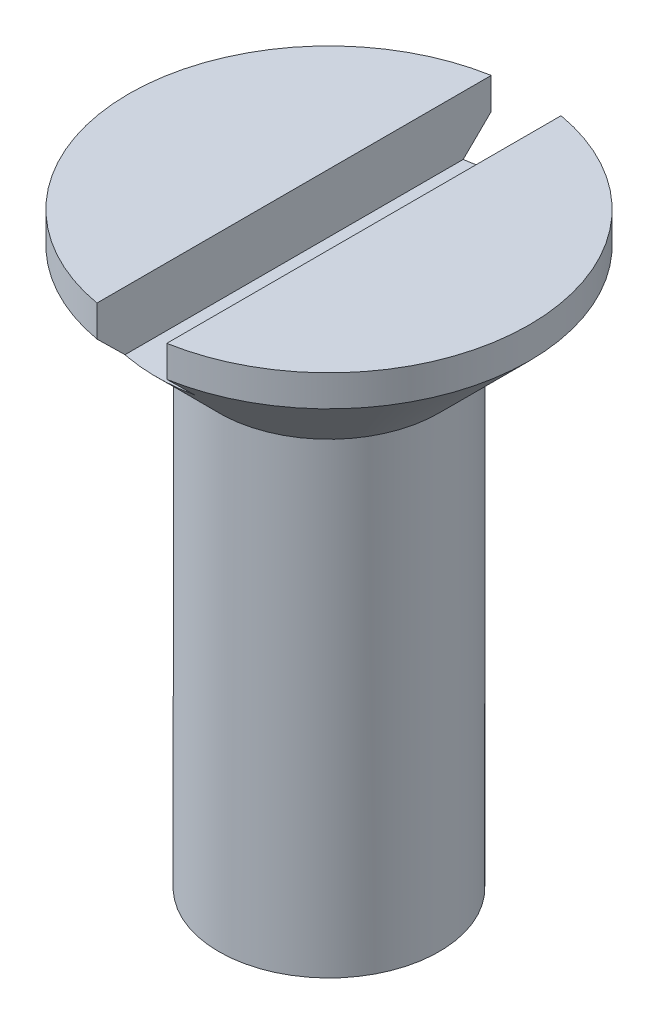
ISO-10303-21;
HEADER;
FILE_DESCRIPTION(('STEP AP214'),'2;1');
FILE_NAME('part.step','',(''),(''),'','','');
FILE_SCHEMA(('AUTOMOTIVE_DESIGN { 1 0 10303 214 1 1 1 1 }'));
ENDSEC;
DATA;
#1=APPLICATION_CONTEXT('core data for automotive mechanical design processes');
#2=APPLICATION_PROTOCOL_DEFINITION('international standard','automotive_design',2000,#1);
#3=PRODUCT_CONTEXT('',#1,'mechanical');
#4=PRODUCT('Part','Part','',(#3));
#5=PRODUCT_RELATED_PRODUCT_CATEGORY('part','',(#4));
#6=PRODUCT_DEFINITION_FORMATION('','',#4);
#7=PRODUCT_DEFINITION_CONTEXT('part definition',#1,'design');
#8=PRODUCT_DEFINITION('design','',#6,#7);
#9=PRODUCT_DEFINITION_SHAPE('','',#8);
#10=(LENGTH_UNIT() NAMED_UNIT(*) SI_UNIT(.MILLI.,.METRE.));
#11=(NAMED_UNIT(*) PLANE_ANGLE_UNIT() SI_UNIT($,.RADIAN.));
#12=(NAMED_UNIT(*) SI_UNIT($,.STERADIAN.) SOLID_ANGLE_UNIT());
#13=UNCERTAINTY_MEASURE_WITH_UNIT(LENGTH_MEASURE(1.E-05),#10,'distance_accuracy_value','');
#14=(GEOMETRIC_REPRESENTATION_CONTEXT(3) GLOBAL_UNCERTAINTY_ASSIGNED_CONTEXT((#13)) GLOBAL_UNIT_ASSIGNED_CONTEXT((#10,
#11,#12)) REPRESENTATION_CONTEXT('',''));
#15=CARTESIAN_POINT('',(0.,0.,0.));
#16=DIRECTION('',(0.,0.,1.));
#17=DIRECTION('',(1.,0.,0.));
#18=AXIS2_PLACEMENT_3D('',#15,#16,#17);
#19=CARTESIAN_POINT('',(0.,17.7320508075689,0.));
#20=DIRECTION('',(0.,-1.,0.));
#21=DIRECTION('',(0.,0.,-1.));
#22=AXIS2_PLACEMENT_3D('',#19,#20,#21);
#23=PLANE('',#22);
#24=CARTESIAN_POINT('',(0.,17.7320508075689,0.));
#25=DIRECTION('',(0.,-1.,0.));
#26=DIRECTION('',(0.,0.,-1.));
#27=AXIS2_PLACEMENT_3D('',#24,#25,#26);
#28=CIRCLE('',#27,5.45);
#29=CARTESIAN_POINT('',(-0.950000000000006,17.7320508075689,5.36656314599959));
#30=VERTEX_POINT('',#29);
#31=CARTESIAN_POINT('',(-0.949999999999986,17.7320508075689,-5.36656314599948));
#32=VERTEX_POINT('',#31);
#33=EDGE_CURVE('E113',#30,#32,#28,.T.);
#34=ORIENTED_EDGE('',*,*,#33,.F.);
#35=DIRECTION('',(0.,0.,1.));
#36=VECTOR('',#35,1.);
#37=CARTESIAN_POINT('',(-0.949999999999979,17.7320508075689,-5.44999999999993));
#38=LINE('',#37,#36);
#39=EDGE_CURVE('E107',#32,#30,#38,.T.);
#40=ORIENTED_EDGE('',*,*,#39,.F.);
#41=EDGE_LOOP('',(#34,#40));
#42=FACE_BOUND('',#41,.T.);
#43=ADVANCED_FACE('F38',(#42),#23,.F.);
#44=CARTESIAN_POINT('',(0.,0.,0.));
#45=DIRECTION('',(0.,-1.,0.));
#46=DIRECTION('',(0.,0.,-1.));
#47=AXIS2_PLACEMENT_3D('',#44,#45,#46);
#48=CYLINDRICAL_SURFACE('',#47,5.45);
#49=CARTESIAN_POINT('',(0.95000000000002,17.7320508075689,-5.36656314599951));
#50=VERTEX_POINT('',#49);
#51=CARTESIAN_POINT('',(0.949999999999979,17.732050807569,5.36656314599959));
#52=VERTEX_POINT('',#51);
#53=EDGE_CURVE('E105',#50,#52,#28,.T.);
#54=ORIENTED_EDGE('',*,*,#53,.T.);
#55=DIRECTION('',(0.,-1.,0.));
#56=VECTOR('',#55,1.);
#57=CARTESIAN_POINT('',(0.95,0.,5.36656314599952));
#58=LINE('',#57,#56);
#59=CARTESIAN_POINT('',(0.949999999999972,16.882050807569,5.36656314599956));
#60=VERTEX_POINT('',#59);
#61=EDGE_CURVE('E90',#52,#60,#58,.T.);
#62=ORIENTED_EDGE('',*,*,#61,.T.);
#63=CARTESIAN_POINT('',(0.,16.8820508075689,0.));
#64=DIRECTION('',(0.,-1.,0.));
#65=DIRECTION('',(0.,0.,-1.));
#66=AXIS2_PLACEMENT_3D('',#63,#64,#65);
#67=CIRCLE('',#66,5.45);
#68=CARTESIAN_POINT('',(0.95000000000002,16.8820508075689,-5.36656314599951));
#69=VERTEX_POINT('',#68);
#70=EDGE_CURVE('E119',#69,#60,#67,.T.);
#71=ORIENTED_EDGE('',*,*,#70,.F.);
#72=DIRECTION('',(0.,-1.,0.));
#73=VECTOR('',#72,1.);
#74=CARTESIAN_POINT('',(0.950000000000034,0.,-5.36656314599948));
#75=LINE('',#74,#73);
#76=EDGE_CURVE('E101',#69,#50,#75,.F.);
#77=ORIENTED_EDGE('',*,*,#76,.T.);
#78=EDGE_LOOP('',(#54,#62,#71,#77));
#79=FACE_BOUND('',#78,.T.);
#80=ADVANCED_FACE('F110',(#79),#48,.T.);
#81=ORIENTED_EDGE('',*,*,#53,.F.);
#82=DIRECTION('',(0.,0.,1.));
#83=VECTOR('',#82,1.);
#84=CARTESIAN_POINT('',(0.949999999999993,17.7320508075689,-5.45000000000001));
#85=LINE('',#84,#83);
#86=EDGE_CURVE('E54',#50,#52,#85,.T.);
#87=ORIENTED_EDGE('',*,*,#86,.T.);
#88=EDGE_LOOP('',(#81,#87));
#89=FACE_BOUND('',#88,.T.);
#90=ADVANCED_FACE('F40',(#89),#23,.F.);
#91=CARTESIAN_POINT('',(0.,1.73205080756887,0.));
#92=DIRECTION('',(0.,1.,0.));
#93=DIRECTION('',(0.,0.,1.));
#94=AXIS2_PLACEMENT_3D('',#91,#92,#93);
#95=CONICAL_SURFACE('',#94,3.,1.0471975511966);
#96=CARTESIAN_POINT('',(0.,0.,0.));
#97=VERTEX_POINT('',#96);
#98=VERTEX_LOOP('',#97);
#99=FACE_BOUND('',#98,.T.);
#100=CARTESIAN_POINT('',(0.,1.73205080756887,0.));
#101=DIRECTION('',(0.,-1.,0.));
#102=DIRECTION('',(0.,0.,-1.));
#103=AXIS2_PLACEMENT_3D('',#100,#101,#102);
#104=CIRCLE('',#103,3.);
#105=CARTESIAN_POINT('',(0.,1.73205080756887,-3.00000000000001));
#106=VERTEX_POINT('',#105);
#107=EDGE_CURVE('E136',#106,#106,#104,.T.);
#108=ORIENTED_EDGE('',*,*,#107,.T.);
#109=EDGE_LOOP('',(#108));
#110=FACE_BOUND('',#109,.T.);
#111=ADVANCED_FACE('F200',(#99,#110),#95,.T.);
#112=CARTESIAN_POINT('',(0.,0.,0.));
#113=DIRECTION('',(0.,-1.,0.));
#114=DIRECTION('',(0.,0.,-1.));
#115=AXIS2_PLACEMENT_3D('',#112,#113,#114);
#116=CYLINDRICAL_SURFACE('',#115,3.);
#117=ORIENTED_EDGE('',*,*,#107,.F.);
#118=EDGE_LOOP('',(#117));
#119=FACE_BOUND('',#118,.T.);
#120=CARTESIAN_POINT('',(0.,14.4320508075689,0.));
#121=DIRECTION('',(0.,-1.,0.));
#122=DIRECTION('',(0.,0.,-1.));
#123=AXIS2_PLACEMENT_3D('',#120,#121,#122);
#124=CIRCLE('',#123,3.);
#125=CARTESIAN_POINT('',(0.,14.4320508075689,-3.00000000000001));
#126=VERTEX_POINT('',#125);
#127=EDGE_CURVE('E132',#126,#126,#124,.T.);
#128=ORIENTED_EDGE('',*,*,#127,.T.);
#129=EDGE_LOOP('',(#128));
#130=FACE_BOUND('',#129,.T.);
#131=ADVANCED_FACE('F192',(#119,#130),#116,.T.);
#132=CARTESIAN_POINT('',(0.,16.8820508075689,0.));
#133=DIRECTION('',(0.,1.,0.));
#134=DIRECTION('',(0.,0.,1.));
#135=AXIS2_PLACEMENT_3D('',#132,#133,#134);
#136=CONICAL_SURFACE('',#135,5.45,0.78539816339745);
#137=CARTESIAN_POINT('',(0.,16.1320508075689,0.));
#138=DIRECTION('',(0.,-1.,0.));
#139=DIRECTION('',(0.,0.,-1.));
#140=AXIS2_PLACEMENT_3D('',#137,#138,#139);
#141=CIRCLE('',#140,4.70000000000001);
#142=CARTESIAN_POINT('',(0.949999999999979,16.1320508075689,4.6029881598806));
#143=VERTEX_POINT('',#142);
#144=CARTESIAN_POINT('',(-0.949999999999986,16.1320508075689,4.60298815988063));
#145=VERTEX_POINT('',#144);
#146=EDGE_CURVE('E11',#143,#145,#141,.T.);
#147=ORIENTED_EDGE('',*,*,#146,.T.);
#148=CARTESIAN_POINT('',(-0.950000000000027,23.4377141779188,-11.9680179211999));
#149=CARTESIAN_POINT('',(-0.949999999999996,23.0135946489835,-11.5425524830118));
#150=CARTESIAN_POINT('',(-0.949999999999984,22.5895349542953,-11.1170273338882));
#151=CARTESIAN_POINT('',(-0.949999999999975,21.7415990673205,-10.2657573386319));
#152=CARTESIAN_POINT('',(-0.949999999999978,21.3177228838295,-9.84001248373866));
#153=CARTESIAN_POINT('',(-0.94999999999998,20.4698091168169,-8.9877918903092));
#154=CARTESIAN_POINT('',(-0.949999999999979,20.0457718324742,-8.56131585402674));
#155=CARTESIAN_POINT('',(-0.949999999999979,19.1981576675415,-7.70794232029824));
#156=CARTESIAN_POINT('',(-0.949999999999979,18.7745807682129,-7.28104484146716));
#157=CARTESIAN_POINT('',(-0.949999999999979,17.9493138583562,-6.44789772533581));
#158=CARTESIAN_POINT('',(-0.949999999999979,17.5475885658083,-6.04168306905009));
#159=CARTESIAN_POINT('',(-0.949999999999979,16.9458631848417,-5.43145875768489));
#160=CARTESIAN_POINT('',(-0.949999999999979,16.7454189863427,-5.22788717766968));
#161=CARTESIAN_POINT('',(-0.949999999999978,16.3449563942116,-4.82033033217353));
#162=CARTESIAN_POINT('',(-0.949999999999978,16.1449379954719,-4.61634507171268));
#163=CARTESIAN_POINT('',(-0.949999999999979,15.7456433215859,-4.20790196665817));
#164=CARTESIAN_POINT('',(-0.949999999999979,15.546366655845,-4.00344450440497));
#165=CARTESIAN_POINT('',(-0.949999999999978,15.1487605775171,-3.59359190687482));
#166=CARTESIAN_POINT('',(-0.949999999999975,14.9504312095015,-3.38819672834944));
#167=CARTESIAN_POINT('',(-0.949999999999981,14.5553805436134,-2.97594606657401));
#168=CARTESIAN_POINT('',(-0.94999999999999,14.3586588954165,-2.76909092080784));
#169=CARTESIAN_POINT('',(-0.949999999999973,14.0658144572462,-2.45672238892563));
#170=CARTESIAN_POINT('',(-0.949999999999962,13.9685762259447,-2.35225583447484));
#171=CARTESIAN_POINT('',(-0.949999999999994,13.7751944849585,-2.14231538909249));
#172=CARTESIAN_POINT('',(-0.950000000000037,13.6790509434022,-2.0368415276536));
#173=CARTESIAN_POINT('',(-0.949999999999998,13.5572142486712,-1.90104874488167));
#174=CARTESIAN_POINT('',(-0.949999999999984,13.5307493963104,-1.8714220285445));
#175=CARTESIAN_POINT('',(-0.949999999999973,13.4779697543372,-1.81203484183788));
#176=CARTESIAN_POINT('',(-0.949999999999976,13.4516549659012,-1.78227437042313));
#177=CARTESIAN_POINT('',(-0.949999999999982,13.372960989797,-1.69276210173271));
#178=CARTESIAN_POINT('',(-0.949999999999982,13.3208372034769,-1.63278502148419));
#179=CARTESIAN_POINT('',(-0.949999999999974,13.2170686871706,-1.5115492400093));
#180=CARTESIAN_POINT('',(-0.949999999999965,13.165431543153,-1.4502840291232));
#181=CARTESIAN_POINT('',(-0.949999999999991,13.0634454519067,-1.32671315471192));
#182=CARTESIAN_POINT('',(-0.950000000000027,13.013096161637,-1.26440777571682));
#183=CARTESIAN_POINT('',(-0.950000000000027,12.9137845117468,-1.13780282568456));
#184=CARTESIAN_POINT('',(-0.949999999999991,12.864838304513,-1.07349051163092));
#185=CARTESIAN_POINT('',(-0.949999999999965,12.7696664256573,-0.942727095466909));
#186=CARTESIAN_POINT('',(-0.949999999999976,12.7234442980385,-0.876273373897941));
#187=CARTESIAN_POINT('',(-0.949999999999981,12.6357723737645,-0.741008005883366));
#188=CARTESIAN_POINT('',(-0.949999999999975,12.5942875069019,-0.672219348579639));
#189=CARTESIAN_POINT('',(-0.949999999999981,12.5186271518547,-0.530760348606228));
#190=CARTESIAN_POINT('',(-0.949999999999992,12.4844302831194,-0.458102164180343));
#191=CARTESIAN_POINT('',(-0.949999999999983,12.4457638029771,-0.354686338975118));
#192=CARTESIAN_POINT('',(-0.949999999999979,12.4360163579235,-0.325909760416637));
#193=CARTESIAN_POINT('',(-0.949999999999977,12.4186586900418,-0.267708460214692));
#194=CARTESIAN_POINT('',(-0.949999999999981,12.4110485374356,-0.238283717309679));
#195=CARTESIAN_POINT('',(-0.949999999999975,12.398336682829,-0.179003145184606));
#196=CARTESIAN_POINT('',(-0.949999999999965,12.3932258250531,-0.149149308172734));
#197=CARTESIAN_POINT('',(-0.949999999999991,12.385755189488,-0.0891008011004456));
#198=CARTESIAN_POINT('',(-0.950000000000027,12.3833947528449,-0.058906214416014));
#199=CARTESIAN_POINT('',(-0.950000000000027,12.3815658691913,0.00176613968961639));
#200=CARTESIAN_POINT('',(-0.949999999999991,12.3821159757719,0.0322444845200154));
#201=CARTESIAN_POINT('',(-0.949999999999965,12.386109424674,0.0930048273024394));
#202=CARTESIAN_POINT('',(-0.949999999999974,12.3895529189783,0.123286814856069));
#203=CARTESIAN_POINT('',(-0.949999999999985,12.4039631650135,0.213629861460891));
#204=CARTESIAN_POINT('',(-0.949999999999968,12.4190123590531,0.273054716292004));
#205=CARTESIAN_POINT('',(-0.949999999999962,12.4572355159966,0.38931444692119));
#206=CARTESIAN_POINT('',(-0.949999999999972,12.4804418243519,0.446137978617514));
#207=CARTESIAN_POINT('',(-0.949999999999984,12.5323422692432,0.557274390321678));
#208=CARTESIAN_POINT('',(-0.949999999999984,12.5610461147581,0.611582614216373));
#209=CARTESIAN_POINT('',(-0.949999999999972,12.6223524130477,0.718506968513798));
#210=CARTESIAN_POINT('',(-0.949999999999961,12.6549851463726,0.771105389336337));
#211=CARTESIAN_POINT('',(-0.949999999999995,12.7227417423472,0.874589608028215));
#212=CARTESIAN_POINT('',(-0.950000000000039,12.7578634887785,0.925476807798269));
#213=CARTESIAN_POINT('',(-0.950000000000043,12.8329848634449,1.03032407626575));
#214=CARTESIAN_POINT('',(-0.949999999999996,12.8731436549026,1.08416927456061));
#215=CARTESIAN_POINT('',(-0.94999999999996,12.9549368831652,1.19073095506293));
#216=CARTESIAN_POINT('',(-0.949999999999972,12.9965715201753,1.2434472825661));
#217=CARTESIAN_POINT('',(-0.94999999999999,13.1231016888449,1.40036538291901));
#218=CARTESIAN_POINT('',(-0.949999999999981,13.2095842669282,1.50328340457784));
#219=CARTESIAN_POINT('',(-0.949999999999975,13.3851076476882,1.70721559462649));
#220=CARTESIAN_POINT('',(-0.949999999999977,13.4741528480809,1.80822592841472));
#221=CARTESIAN_POINT('',(-0.949999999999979,13.6537505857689,2.00884178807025));
#222=CARTESIAN_POINT('',(-0.949999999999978,13.7443026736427,2.10844771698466));
#223=CARTESIAN_POINT('',(-0.949999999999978,13.9261405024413,2.30640440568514));
#224=CARTESIAN_POINT('',(-0.949999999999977,14.0174230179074,2.40475813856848));
#225=CARTESIAN_POINT('',(-0.949999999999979,14.2007096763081,2.60080364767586));
#226=CARTESIAN_POINT('',(-0.949999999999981,14.292713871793,2.6984953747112));
#227=CARTESIAN_POINT('',(-0.949999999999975,14.477140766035,2.89327704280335));
#228=CARTESIAN_POINT('',(-0.949999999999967,14.5695628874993,2.990367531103));
#229=CARTESIAN_POINT('',(-0.949999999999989,14.7547965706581,3.18417143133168));
#230=CARTESIAN_POINT('',(-0.950000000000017,14.8476081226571,3.28088485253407));
#231=CARTESIAN_POINT('',(-0.950000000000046,15.1154667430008,3.55914225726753));
#232=CARTESIAN_POINT('',(-0.949999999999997,15.2908928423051,3.74032125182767));
#233=CARTESIAN_POINT('',(-0.949999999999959,15.6424264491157,4.10201729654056));
#234=CARTESIAN_POINT('',(-0.949999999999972,15.8185339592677,4.28253434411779));
#235=CARTESIAN_POINT('',(-0.949999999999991,16.3475508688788,4.82341933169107));
#236=CARTESIAN_POINT('',(-0.949999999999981,16.7011480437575,5.18311429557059));
#237=CARTESIAN_POINT('',(-0.949999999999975,17.4094808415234,5.90175717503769));
#238=CARTESIAN_POINT('',(-0.949999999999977,17.764216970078,6.2607045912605));
#239=CARTESIAN_POINT('',(-0.949999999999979,18.4742623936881,6.97802571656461));
#240=CARTESIAN_POINT('',(-0.949999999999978,18.8295716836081,7.33639943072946));
#241=CARTESIAN_POINT('',(-0.949999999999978,19.5390760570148,8.05128885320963));
#242=CARTESIAN_POINT('',(-0.949999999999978,19.8932696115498,8.40780607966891));
#243=CARTESIAN_POINT('',(-0.949999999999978,20.6019069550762,9.12059384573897));
#244=CARTESIAN_POINT('',(-0.949999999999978,20.95635074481,9.47686438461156));
#245=CARTESIAN_POINT('',(-0.949999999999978,21.6652080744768,10.1890227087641));
#246=CARTESIAN_POINT('',(-0.949999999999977,22.019621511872,10.5449105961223));
#247=CARTESIAN_POINT('',(-0.94999999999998,22.7285798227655,11.2565531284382));
#248=CARTESIAN_POINT('',(-0.949999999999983,23.0831246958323,11.6123077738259));
#249=CARTESIAN_POINT('',(-0.949999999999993,23.4377141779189,11.9680179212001));
#250=B_SPLINE_CURVE_WITH_KNOTS('',3,(#148,#149,#150,#151,#152,#153,#154,#155,#156,#157,#158,
#159,#160,#161,#162,#163,#164,#165,#166,#167,#168,#169,#170,#171,#172,#173,#174,#175,#176,#177,
#178,#179,#180,#181,#182,#183,#184,#185,#186,#187,#188,#189,#190,#191,#192,#193,#194,#195,#196,
#197,#198,#199,#200,#201,#202,#203,#204,#205,#206,#207,#208,#209,#210,#211,#212,#213,#214,#215,
#216,#217,#218,#219,#220,#221,#222,#223,#224,#225,#226,#227,#228,#229,#230,#231,#232,#233,#234,
#235,#236,#237,#238,#239,#240,#241,#242,#243,#244,#245,#246,#247,#248,#249),.UNSPECIFIED.,.F.,
.F.,(4,2,2,2,2,2,2,2,2,2,2,2,2,2,2,2,2,2,2,2,2,2,2,2,2,2,2,2,2,2,2,2,2,2,2,2,2,2,2,2,2,2,2,2,2,
2,2,2,2,2,4),(0.,1.80224419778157,3.60456688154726,5.40878527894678,7.21292726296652,
8.9268515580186,9.78392367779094,10.6409854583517,11.4975030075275,12.354060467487,
13.210426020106,13.6385769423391,14.0667153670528,14.1858920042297,14.3050695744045,
14.5434471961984,14.7838067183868,15.0241015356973,15.2665160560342,15.5092392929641,
15.7500297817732,15.9901038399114,16.0811847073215,16.1722685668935,16.2630162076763,
16.3537421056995,16.4450470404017,16.5363567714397,16.7193699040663,16.9031170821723,
17.0871918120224,17.2727889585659,17.4582301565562,17.6597095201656,17.8612163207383,
18.2644272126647,18.6683770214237,19.0722084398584,19.474762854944,19.8773468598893,
20.2794843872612,20.6816119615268,21.4381807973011,22.1947525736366,23.7079246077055,
25.2219018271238,26.7358655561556,28.2435187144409,29.7511763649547,31.2579562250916,
32.7647311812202),.UNSPECIFIED.);
#251=CARTESIAN_POINT('',(-0.950000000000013,16.8820508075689,5.36656314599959));
#252=VERTEX_POINT('',#251);
#253=EDGE_CURVE('E124',#145,#252,#250,.T.);
#254=ORIENTED_EDGE('',*,*,#253,.T.);
#255=CARTESIAN_POINT('',(-0.949999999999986,16.8820508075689,-5.36656314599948));
#256=VERTEX_POINT('',#255);
#257=EDGE_CURVE('E112',#252,#256,#67,.T.);
#258=ORIENTED_EDGE('',*,*,#257,.T.);
#259=CARTESIAN_POINT('',(-0.950000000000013,16.1320508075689,-4.60298815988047));
#260=VERTEX_POINT('',#259);
#261=EDGE_CURVE('E122',#256,#260,#250,.T.);
#262=ORIENTED_EDGE('',*,*,#261,.T.);
#263=CARTESIAN_POINT('',(0.949999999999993,16.1320508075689,-4.60298815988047));
#264=VERTEX_POINT('',#263);
#265=EDGE_CURVE('E42',#260,#264,#141,.T.);
#266=ORIENTED_EDGE('',*,*,#265,.T.);
#267=CARTESIAN_POINT('',(0.949999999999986,23.4377141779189,11.9680179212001));
#268=CARTESIAN_POINT('',(0.94999999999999,23.0135946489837,11.542552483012));
#269=CARTESIAN_POINT('',(0.949999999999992,22.5895349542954,11.1170273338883));
#270=CARTESIAN_POINT('',(0.949999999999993,21.7415990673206,10.265757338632));
#271=CARTESIAN_POINT('',(0.949999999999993,21.3177228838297,9.84001248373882));
#272=CARTESIAN_POINT('',(0.949999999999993,20.469809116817,8.98779189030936));
#273=CARTESIAN_POINT('',(0.949999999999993,20.0457718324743,8.56131585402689));
#274=CARTESIAN_POINT('',(0.949999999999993,19.1981576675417,7.70794232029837));
#275=CARTESIAN_POINT('',(0.949999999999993,18.7745807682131,7.28104484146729));
#276=CARTESIAN_POINT('',(0.949999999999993,17.9493138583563,6.44789772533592));
#277=CARTESIAN_POINT('',(0.949999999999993,17.5475885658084,6.04168306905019));
#278=CARTESIAN_POINT('',(0.949999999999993,16.9458631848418,5.43145875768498));
#279=CARTESIAN_POINT('',(0.949999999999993,16.7454189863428,5.22788717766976));
#280=CARTESIAN_POINT('',(0.949999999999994,16.3449563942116,4.82033033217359));
#281=CARTESIAN_POINT('',(0.949999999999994,16.144937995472,4.61634507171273));
#282=CARTESIAN_POINT('',(0.949999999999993,15.745643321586,4.20790196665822));
#283=CARTESIAN_POINT('',(0.949999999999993,15.5463666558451,4.00344450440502));
#284=CARTESIAN_POINT('',(0.949999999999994,15.1487605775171,3.59359190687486));
#285=CARTESIAN_POINT('',(0.949999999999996,14.9504312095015,3.38819672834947));
#286=CARTESIAN_POINT('',(0.949999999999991,14.5553805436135,2.97594606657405));
#287=CARTESIAN_POINT('',(0.949999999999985,14.3586588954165,2.76909092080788));
#288=CARTESIAN_POINT('',(0.949999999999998,14.0658144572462,2.45672238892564));
#289=CARTESIAN_POINT('',(0.950000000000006,13.9685762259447,2.35225583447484));
#290=CARTESIAN_POINT('',(0.949999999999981,13.7751944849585,2.14231538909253));
#291=CARTESIAN_POINT('',(0.949999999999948,13.6790509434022,2.03684152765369));
#292=CARTESIAN_POINT('',(0.949999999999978,13.5572142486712,1.90104874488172));
#293=CARTESIAN_POINT('',(0.94999999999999,13.5307493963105,1.87142202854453));
#294=CARTESIAN_POINT('',(0.949999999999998,13.4779697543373,1.8120348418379));
#295=CARTESIAN_POINT('',(0.949999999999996,13.4516549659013,1.78227437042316));
#296=CARTESIAN_POINT('',(0.94999999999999,13.3729609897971,1.69276210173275));
#297=CARTESIAN_POINT('',(0.94999999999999,13.320837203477,1.63278502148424));
#298=CARTESIAN_POINT('',(0.949999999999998,13.2170686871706,1.51154924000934));
#299=CARTESIAN_POINT('',(0.950000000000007,13.1654315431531,1.45028402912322));
#300=CARTESIAN_POINT('',(0.94999999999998,13.0634454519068,1.32671315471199));
#301=CARTESIAN_POINT('',(0.949999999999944,13.013096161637,1.26440777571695));
#302=CARTESIAN_POINT('',(0.949999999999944,12.9137845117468,1.1378028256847));
#303=CARTESIAN_POINT('',(0.94999999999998,12.864838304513,1.07349051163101));
#304=CARTESIAN_POINT('',(0.950000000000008,12.7696664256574,0.942727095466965));
#305=CARTESIAN_POINT('',(0.949999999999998,12.7234442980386,0.876273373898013));
#306=CARTESIAN_POINT('',(0.94999999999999,12.6357723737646,0.741008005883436));
#307=CARTESIAN_POINT('',(0.94999999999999,12.594287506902,0.672219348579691));
#308=CARTESIAN_POINT('',(0.949999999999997,12.5186271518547,0.530760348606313));
#309=CARTESIAN_POINT('',(0.950000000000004,12.4844302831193,0.458102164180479));
#310=CARTESIAN_POINT('',(0.949999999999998,12.4457638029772,0.354686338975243));
#311=CARTESIAN_POINT('',(0.949999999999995,12.4360163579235,0.325909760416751));
#312=CARTESIAN_POINT('',(0.949999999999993,12.4186586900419,0.267708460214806));
#313=CARTESIAN_POINT('',(0.949999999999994,12.4110485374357,0.238283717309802));
#314=CARTESIAN_POINT('',(0.949999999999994,12.398336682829,0.179003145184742));
#315=CARTESIAN_POINT('',(0.949999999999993,12.3932258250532,0.149149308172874));
#316=CARTESIAN_POINT('',(0.949999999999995,12.3857551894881,0.0891008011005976));
#317=CARTESIAN_POINT('',(0.95,12.3833947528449,0.0589062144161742));
#318=CARTESIAN_POINT('',(0.949999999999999,12.3815658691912,-0.00176613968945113));
#319=CARTESIAN_POINT('',(0.949999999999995,12.382115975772,-0.0322444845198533));
#320=CARTESIAN_POINT('',(0.949999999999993,12.386109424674,-0.093004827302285));
#321=CARTESIAN_POINT('',(0.949999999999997,12.3895529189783,-0.123286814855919));
#322=CARTESIAN_POINT('',(0.949999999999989,12.4039631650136,-0.213629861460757));
#323=CARTESIAN_POINT('',(0.949999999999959,12.4190123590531,-0.273054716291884));
#324=CARTESIAN_POINT('',(0.949999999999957,12.4572355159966,-0.38931444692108));
#325=CARTESIAN_POINT('',(0.949999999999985,12.4804418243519,-0.446137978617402));
#326=CARTESIAN_POINT('',(0.950000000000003,12.5323422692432,-0.557274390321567));
#327=CARTESIAN_POINT('',(0.949999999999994,12.5610461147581,-0.611582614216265));
#328=CARTESIAN_POINT('',(0.949999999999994,12.6223524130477,-0.718506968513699));
#329=CARTESIAN_POINT('',(0.950000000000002,12.6549851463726,-0.771105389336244));
#330=CARTESIAN_POINT('',(0.949999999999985,12.7227417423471,-0.874589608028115));
#331=CARTESIAN_POINT('',(0.949999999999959,12.7578634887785,-0.925476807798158));
#332=CARTESIAN_POINT('',(0.949999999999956,12.8329848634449,-1.03032407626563));
#333=CARTESIAN_POINT('',(0.949999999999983,12.8731436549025,-1.08416927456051));
#334=CARTESIAN_POINT('',(0.950000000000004,12.9549368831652,-1.19073095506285));
#335=CARTESIAN_POINT('',(0.949999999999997,12.9965715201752,-1.24344728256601));
#336=CARTESIAN_POINT('',(0.949999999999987,13.1231016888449,-1.40036538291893));
#337=CARTESIAN_POINT('',(0.949999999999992,13.2095842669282,-1.50328340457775));
#338=CARTESIAN_POINT('',(0.949999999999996,13.3851076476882,-1.7072155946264));
#339=CARTESIAN_POINT('',(0.949999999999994,13.4741528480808,-1.80822592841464));
#340=CARTESIAN_POINT('',(0.949999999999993,13.6537505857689,-2.00884178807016));
#341=CARTESIAN_POINT('',(0.949999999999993,13.7443026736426,-2.10844771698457));
#342=CARTESIAN_POINT('',(0.949999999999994,13.9261405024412,-2.30640440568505));
#343=CARTESIAN_POINT('',(0.949999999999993,14.0174230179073,-2.4047581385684));
#344=CARTESIAN_POINT('',(0.949999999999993,14.2007096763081,-2.60080364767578));
#345=CARTESIAN_POINT('',(0.949999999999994,14.292713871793,-2.69849537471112));
#346=CARTESIAN_POINT('',(0.949999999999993,14.4771407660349,-2.89327704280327));
#347=CARTESIAN_POINT('',(0.949999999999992,14.5695628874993,-2.99036753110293));
#348=CARTESIAN_POINT('',(0.949999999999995,14.7547965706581,-3.18417143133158));
#349=CARTESIAN_POINT('',(0.949999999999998,14.8476081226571,-3.28088485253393));
#350=CARTESIAN_POINT('',(0.950000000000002,15.1154667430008,-3.55914225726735));
#351=CARTESIAN_POINT('',(0.949999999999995,15.2908928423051,-3.74032125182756));
#352=CARTESIAN_POINT('',(0.949999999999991,15.6424264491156,-4.1020172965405));
#353=CARTESIAN_POINT('',(0.949999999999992,15.8185339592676,-4.28253434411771));
#354=CARTESIAN_POINT('',(0.949999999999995,16.3475508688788,-4.82341933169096));
#355=CARTESIAN_POINT('',(0.949999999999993,16.7011480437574,-5.18311429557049));
#356=CARTESIAN_POINT('',(0.949999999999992,17.4094808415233,-5.90175717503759));
#357=CARTESIAN_POINT('',(0.949999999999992,17.7642169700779,-6.2607045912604));
#358=CARTESIAN_POINT('',(0.949999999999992,18.474262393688,-6.9780257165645));
#359=CARTESIAN_POINT('',(0.949999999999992,18.829571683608,-7.33639943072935));
#360=CARTESIAN_POINT('',(0.949999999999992,19.5390760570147,-8.05128885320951));
#361=CARTESIAN_POINT('',(0.949999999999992,19.8932696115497,-8.40780607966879));
#362=CARTESIAN_POINT('',(0.949999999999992,20.6019069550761,-9.12059384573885));
#363=CARTESIAN_POINT('',(0.949999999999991,20.9563507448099,-9.47686438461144));
#364=CARTESIAN_POINT('',(0.949999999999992,21.6652080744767,-10.189022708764));
#365=CARTESIAN_POINT('',(0.949999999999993,22.0196215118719,-10.5449105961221));
#366=CARTESIAN_POINT('',(0.949999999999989,22.7285798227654,-11.256553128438));
#367=CARTESIAN_POINT('',(0.949999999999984,23.0831246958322,-11.6123077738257));
#368=CARTESIAN_POINT('',(0.949999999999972,23.4377141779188,-11.9680179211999));
#369=B_SPLINE_CURVE_WITH_KNOTS('',3,(#267,#268,#269,#270,#271,#272,#273,#274,#275,#276,#277,
#278,#279,#280,#281,#282,#283,#284,#285,#286,#287,#288,#289,#290,#291,#292,#293,#294,#295,#296,
#297,#298,#299,#300,#301,#302,#303,#304,#305,#306,#307,#308,#309,#310,#311,#312,#313,#314,#315,
#316,#317,#318,#319,#320,#321,#322,#323,#324,#325,#326,#327,#328,#329,#330,#331,#332,#333,#334,
#335,#336,#337,#338,#339,#340,#341,#342,#343,#344,#345,#346,#347,#348,#349,#350,#351,#352,#353,
#354,#355,#356,#357,#358,#359,#360,#361,#362,#363,#364,#365,#366,#367,#368),.UNSPECIFIED.,.F.,
.F.,(4,2,2,2,2,2,2,2,2,2,2,2,2,2,2,2,2,2,2,2,2,2,2,2,2,2,2,2,2,2,2,2,2,2,2,2,2,2,2,2,2,2,2,2,2,
2,2,2,2,2,4),(0.,1.80224419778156,3.60456688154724,5.40878527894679,7.21292726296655,
8.92685155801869,9.78392367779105,10.6409854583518,11.4975030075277,12.3540604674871,
13.2104260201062,13.6385769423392,14.066715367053,14.1858920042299,14.3050695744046,
14.5434471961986,14.783806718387,15.0241015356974,15.2665160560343,15.5092392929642,
15.7500297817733,15.9901038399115,16.0811847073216,16.1722685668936,16.2630162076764,
16.3537421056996,16.4450470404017,16.5363567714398,16.7193699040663,16.9031170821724,
17.0871918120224,17.2727889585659,17.4582301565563,17.6597095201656,17.8612163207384,
18.2644272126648,18.6683770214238,19.0722084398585,19.4747628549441,19.8773468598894,
20.2794843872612,20.6816119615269,21.4381807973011,22.1947525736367,23.7079246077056,
25.2219018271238,26.7358655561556,28.2435187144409,29.7511763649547,31.2579562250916,
32.7647311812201),.UNSPECIFIED.);
#370=EDGE_CURVE('E158',#264,#69,#369,.T.);
#371=ORIENTED_EDGE('',*,*,#370,.T.);
#372=ORIENTED_EDGE('',*,*,#70,.T.);
#373=EDGE_CURVE('E94',#60,#143,#369,.T.);
#374=ORIENTED_EDGE('',*,*,#373,.T.);
#375=EDGE_LOOP('',(#147,#254,#258,#262,#266,#371,#372,#374));
#376=FACE_BOUND('',#375,.T.);
#377=ORIENTED_EDGE('',*,*,#127,.F.);
#378=EDGE_LOOP('',(#377));
#379=FACE_BOUND('',#378,.T.);
#380=ADVANCED_FACE('F156',(#376,#379),#136,.T.);
#381=ORIENTED_EDGE('',*,*,#33,.T.);
#382=DIRECTION('',(0.,-1.,0.));
#383=VECTOR('',#382,1.);
#384=CARTESIAN_POINT('',(-0.949999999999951,0.,-5.36656314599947));
#385=LINE('',#384,#383);
#386=EDGE_CURVE('E144',#32,#256,#385,.T.);
#387=ORIENTED_EDGE('',*,*,#386,.T.);
#388=ORIENTED_EDGE('',*,*,#257,.F.);
#389=DIRECTION('',(0.,-1.,0.));
#390=VECTOR('',#389,1.);
#391=CARTESIAN_POINT('',(-0.950000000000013,0.,5.36656314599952));
#392=LINE('',#391,#390);
#393=EDGE_CURVE('E100',#252,#30,#392,.F.);
#394=ORIENTED_EDGE('',*,*,#393,.T.);
#395=EDGE_LOOP('',(#381,#387,#388,#394));
#396=FACE_BOUND('',#395,.T.);
#397=ADVANCED_FACE('F185',(#396),#48,.T.);
#398=CARTESIAN_POINT('',(-0.949999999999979,16.1320508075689,-5.44999999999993));
#399=DIRECTION('',(0.,-1.,0.));
#400=DIRECTION('',(0.,0.,-1.));
#401=AXIS2_PLACEMENT_3D('',#398,#399,#400);
#402=PLANE('',#401);
#403=DIRECTION('',(0.,0.,1.));
#404=VECTOR('',#403,1.);
#405=CARTESIAN_POINT('',(0.949999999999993,16.1320508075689,-5.45000000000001));
#406=LINE('',#405,#404);
#407=EDGE_CURVE('E108',#264,#143,#406,.T.);
#408=ORIENTED_EDGE('',*,*,#407,.F.);
#409=ORIENTED_EDGE('',*,*,#265,.F.);
#410=DIRECTION('',(0.,0.,1.));
#411=VECTOR('',#410,1.);
#412=CARTESIAN_POINT('',(-0.949999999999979,16.1320508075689,-5.44999999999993));
#413=LINE('',#412,#411);
#414=EDGE_CURVE('E164',#260,#145,#413,.T.);
#415=ORIENTED_EDGE('',*,*,#414,.T.);
#416=ORIENTED_EDGE('',*,*,#146,.F.);
#417=EDGE_LOOP('',(#408,#409,#415,#416));
#418=FACE_BOUND('',#417,.T.);
#419=ADVANCED_FACE('F163',(#418),#402,.F.);
#420=CARTESIAN_POINT('',(-0.949999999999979,17.7320508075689,-5.44999999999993));
#421=DIRECTION('',(-1.,0.,0.));
#422=DIRECTION('',(0.,-1.,0.));
#423=AXIS2_PLACEMENT_3D('',#420,#421,#422);
#424=PLANE('',#423);
#425=ORIENTED_EDGE('',*,*,#386,.F.);
#426=ORIENTED_EDGE('',*,*,#39,.T.);
#427=ORIENTED_EDGE('',*,*,#393,.F.);
#428=ORIENTED_EDGE('',*,*,#253,.F.);
#429=ORIENTED_EDGE('',*,*,#414,.F.);
#430=ORIENTED_EDGE('',*,*,#261,.F.);
#431=EDGE_LOOP('',(#425,#426,#427,#428,#429,#430));
#432=FACE_BOUND('',#431,.T.);
#433=ADVANCED_FACE('F166',(#432),#424,.F.);
#434=CARTESIAN_POINT('',(0.949999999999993,17.7320508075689,-5.45000000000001));
#435=DIRECTION('',(1.,0.,0.));
#436=DIRECTION('',(0.,1.,0.));
#437=AXIS2_PLACEMENT_3D('',#434,#435,#436);
#438=PLANE('',#437);
#439=ORIENTED_EDGE('',*,*,#61,.F.);
#440=ORIENTED_EDGE('',*,*,#86,.F.);
#441=ORIENTED_EDGE('',*,*,#76,.F.);
#442=ORIENTED_EDGE('',*,*,#370,.F.);
#443=ORIENTED_EDGE('',*,*,#407,.T.);
#444=ORIENTED_EDGE('',*,*,#373,.F.);
#445=EDGE_LOOP('',(#439,#440,#441,#442,#443,#444));
#446=FACE_BOUND('',#445,.T.);
#447=ADVANCED_FACE('F91',(#446),#438,.F.);
#448=CLOSED_SHELL('',(#43,#80,#90,#111,#131,#380,#397,#419,#433,#447));
#449=MANIFOLD_SOLID_BREP('B2',#448);
#450=ADVANCED_BREP_SHAPE_REPRESENTATION('',(#18,#449),#14);
#451=SHAPE_DEFINITION_REPRESENTATION(#9,#450);
ENDSEC;
END-ISO-10303-21;
